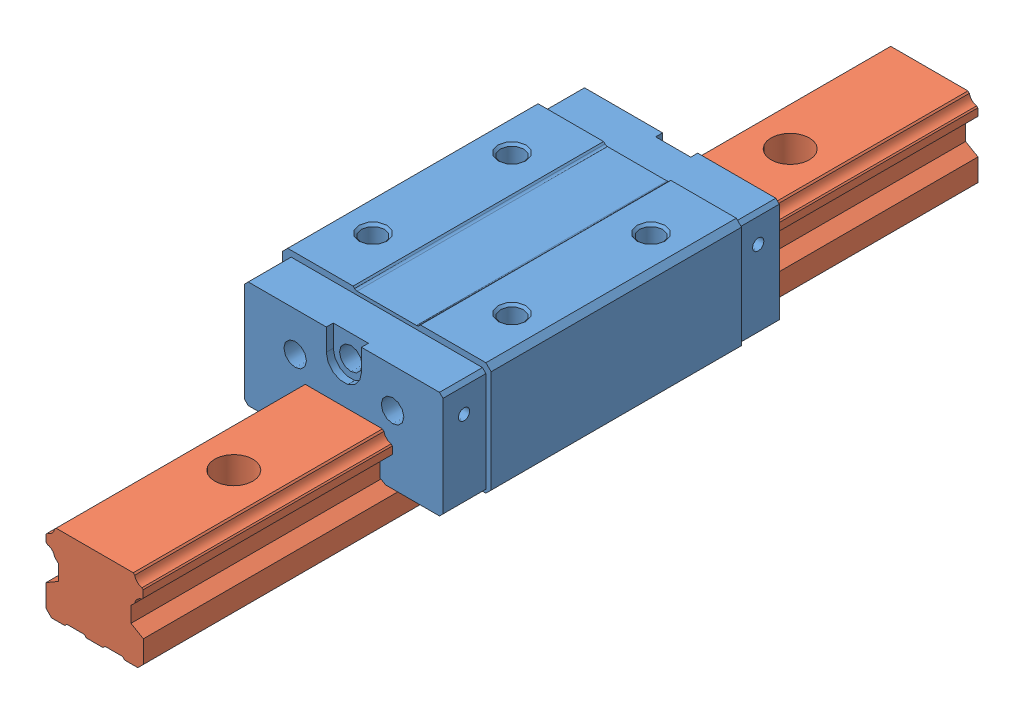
SolidWorks assembly IAS01-H42-L240.sldasm, configuration Default (file format 13000). Lengths in mm.
Overall size (60 42.01 240).
2 component instances, 2 part files, 0 mates.
Components (placement in the parent):
- ELH30CA-1: ELH30CA.SLDPRT [Default] at (0 42 -71.65) size (60 32.5 96.7)
- ELR30R240 E=40-1: ELR30R240 E=40.SLDPRT [Default] at (0 42 0) size (28 23.01 240)
